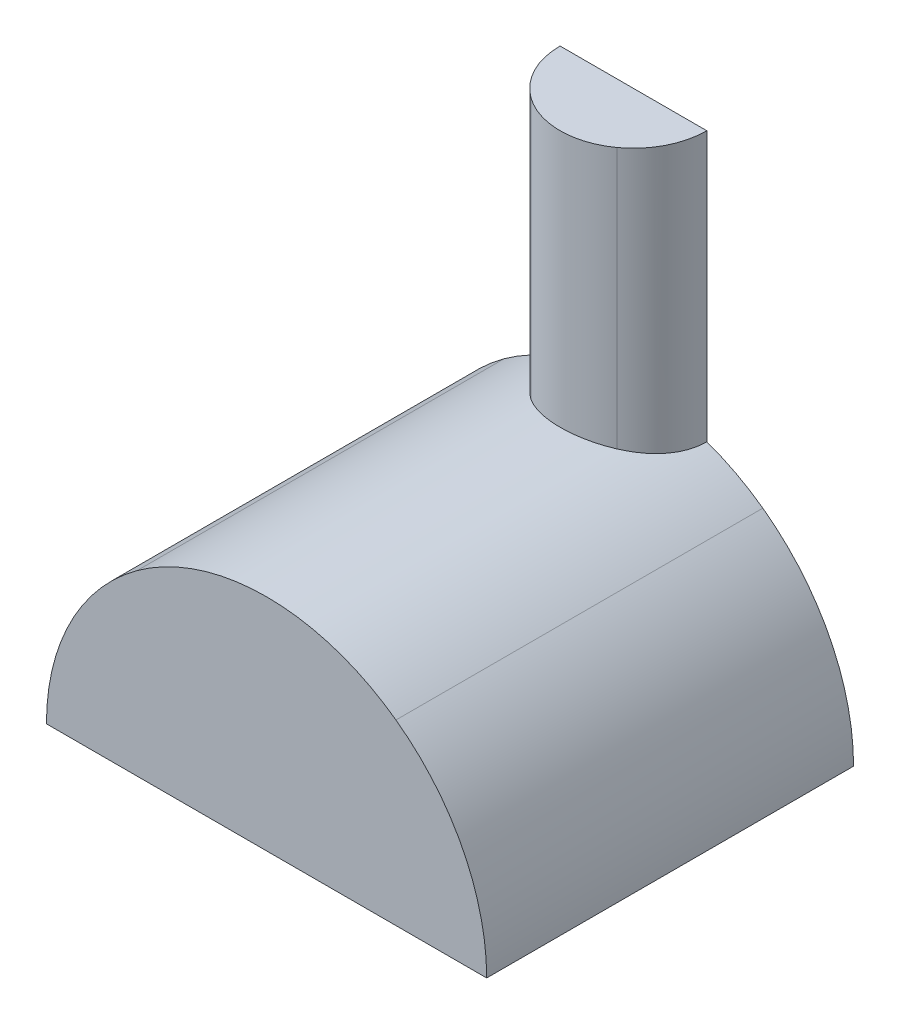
from build123d import *

# Parameters (mm, degrees)
BOSS_EXTRUDE1_DEPTH = 2540
BOSS_EXTRUDE2_DEPTH = 3302


with BuildPart() as part:
    # Sketch1 → Boss-Extrude1 (new body)
    with BuildSketch(Plane.XY):
        with BuildLine():
            Line((-1524, 0), (1524, 0))
            ThreePointArc((1524, 0), (0, 1524), (-1524, 0))
        make_face()
    extrude(amount=BOSS_EXTRUDE1_DEPTH)

    # Sketch2 → Boss-Extrude2 (add)
    with BuildSketch(Plane.XZ):
        with BuildLine():
            Line((508, 0), (-508, 0))
            ThreePointArc((-508, 0), (0, 508), (508, 0))
        make_face()
    extrude(amount=-BOSS_EXTRUDE2_DEPTH)


solid = part.part
